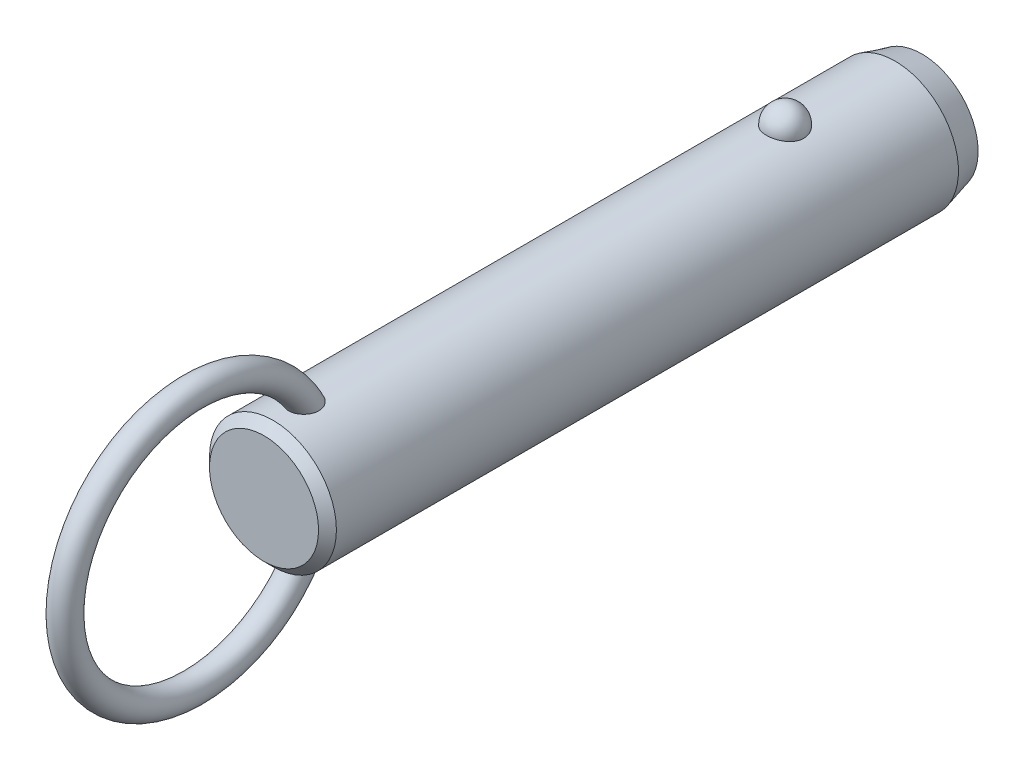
ISO-10303-21;
HEADER;
FILE_DESCRIPTION(('STEP AP214'),'2;1');
FILE_NAME('part.step','',(''),(''),'','','');
FILE_SCHEMA(('AUTOMOTIVE_DESIGN { 1 0 10303 214 1 1 1 1 }'));
ENDSEC;
DATA;
#1=APPLICATION_CONTEXT('core data for automotive mechanical design processes');
#2=APPLICATION_PROTOCOL_DEFINITION('international standard','automotive_design',2000,#1);
#3=PRODUCT_CONTEXT('',#1,'mechanical');
#4=PRODUCT('Part','Part','',(#3));
#5=PRODUCT_RELATED_PRODUCT_CATEGORY('part','',(#4));
#6=PRODUCT_DEFINITION_FORMATION('','',#4);
#7=PRODUCT_DEFINITION_CONTEXT('part definition',#1,'design');
#8=PRODUCT_DEFINITION('design','',#6,#7);
#9=PRODUCT_DEFINITION_SHAPE('','',#8);
#10=(LENGTH_UNIT() NAMED_UNIT(*) SI_UNIT(.MILLI.,.METRE.));
#11=(NAMED_UNIT(*) PLANE_ANGLE_UNIT() SI_UNIT($,.RADIAN.));
#12=(NAMED_UNIT(*) SI_UNIT($,.STERADIAN.) SOLID_ANGLE_UNIT());
#13=UNCERTAINTY_MEASURE_WITH_UNIT(LENGTH_MEASURE(1.E-05),#10,'distance_accuracy_value','');
#14=(GEOMETRIC_REPRESENTATION_CONTEXT(3) GLOBAL_UNCERTAINTY_ASSIGNED_CONTEXT((#13)) GLOBAL_UNIT_ASSIGNED_CONTEXT((#10,
#11,#12)) REPRESENTATION_CONTEXT('',''));
#15=CARTESIAN_POINT('',(0.,0.,0.));
#16=DIRECTION('',(0.,0.,1.));
#17=DIRECTION('',(1.,0.,0.));
#18=AXIS2_PLACEMENT_3D('',#15,#16,#17);
#19=CARTESIAN_POINT('',(0.,0.,48.3));
#20=DIRECTION('',(0.,0.,-1.));
#21=DIRECTION('',(-1.,0.,0.));
#22=AXIS2_PLACEMENT_3D('',#19,#20,#21);
#23=CYLINDRICAL_SURFACE('',#22,7.1);
#24=CARTESIAN_POINT('',(2.0769088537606,6.78943661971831,-2.1));
#25=CARTESIAN_POINT('',(2.07690739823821,6.78943796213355,-1.98268154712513));
#26=CARTESIAN_POINT('',(2.06738130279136,6.79237331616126,-1.86534506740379));
#27=CARTESIAN_POINT('',(2.0295040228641,6.8037853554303,-1.63400788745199));
#28=CARTESIAN_POINT('',(2.00114757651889,6.81226358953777,-1.52000812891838));
#29=CARTESIAN_POINT('',(1.92632025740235,6.83379798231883,-1.29863433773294));
#30=CARTESIAN_POINT('',(1.87985726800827,6.84685214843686,-1.19125744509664));
#31=CARTESIAN_POINT('',(1.76995205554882,6.87608091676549,-0.986046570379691));
#32=CARTESIAN_POINT('',(1.70650980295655,6.8922555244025,-0.888212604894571));
#33=CARTESIAN_POINT('',(1.56381192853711,6.92602930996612,-0.704242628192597));
#34=CARTESIAN_POINT('',(1.4844714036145,6.94363582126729,-0.618173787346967));
#35=CARTESIAN_POINT('',(1.31221746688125,6.97823658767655,-0.460740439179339));
#36=CARTESIAN_POINT('',(1.21930409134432,6.99523084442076,-0.389375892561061));
#37=CARTESIAN_POINT('',(1.02268781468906,7.02666176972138,-0.263547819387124));
#38=CARTESIAN_POINT('',(0.919020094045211,7.04110638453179,-0.209031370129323));
#39=CARTESIAN_POINT('',(0.703548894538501,7.06588726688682,-0.118163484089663));
#40=CARTESIAN_POINT('',(0.591746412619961,7.07622403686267,-0.081809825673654));
#41=CARTESIAN_POINT('',(0.365557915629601,7.09147068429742,-0.0288711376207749));
#42=CARTESIAN_POINT('',(0.251267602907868,7.09648447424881,-0.0119070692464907));
#43=CARTESIAN_POINT('',(0.0213499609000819,7.10089837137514,0.00304925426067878));
#44=CARTESIAN_POINT('',(-0.0942772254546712,7.10029907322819,0.00104351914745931));
#45=CARTESIAN_POINT('',(-0.321651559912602,7.09360829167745,-0.0216931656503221));
#46=CARTESIAN_POINT('',(-0.433431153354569,7.08760388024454,-0.0421272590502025));
#47=CARTESIAN_POINT('',(-0.651862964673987,7.07086131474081,-0.100729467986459));
#48=CARTESIAN_POINT('',(-0.758515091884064,7.06012307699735,-0.138897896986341));
#49=CARTESIAN_POINT('',(-0.96444924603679,7.03496097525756,-0.232213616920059));
#50=CARTESIAN_POINT('',(-1.06368095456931,7.02051445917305,-0.287465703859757));
#51=CARTESIAN_POINT('',(-1.25145353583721,6.98948740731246,-0.413383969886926));
#52=CARTESIAN_POINT('',(-1.33999321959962,6.97290663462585,-0.48405186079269));
#53=CARTESIAN_POINT('',(-1.50591604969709,6.93898770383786,-0.640594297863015));
#54=CARTESIAN_POINT('',(-1.58302488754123,6.92164094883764,-0.72675782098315));
#55=CARTESIAN_POINT('',(-1.72189320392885,6.8884103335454,-0.910927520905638));
#56=CARTESIAN_POINT('',(-1.78365144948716,6.87252659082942,-1.008934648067));
#57=CARTESIAN_POINT('',(-1.89101272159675,6.84377189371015,-1.21549497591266));
#58=CARTESIAN_POINT('',(-1.93639553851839,6.83094274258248,-1.32416860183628));
#59=CARTESIAN_POINT('',(-2.00874275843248,6.81002070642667,-1.54791500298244));
#60=CARTESIAN_POINT('',(-2.03570774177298,6.80192767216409,-1.66298757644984));
#61=CARTESIAN_POINT('',(-2.07047276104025,6.7914266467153,-1.89571453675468));
#62=CARTESIAN_POINT('',(-2.07835878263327,6.78899315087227,-2.01335491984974));
#63=CARTESIAN_POINT('',(-2.07502083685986,6.79001409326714,-2.24833570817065));
#64=CARTESIAN_POINT('',(-2.06379746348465,6.7934683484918,-2.36567612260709));
#65=CARTESIAN_POINT('',(-2.02263913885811,6.80583442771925,-2.59603194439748));
#66=CARTESIAN_POINT('',(-1.99281127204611,6.81471501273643,-2.70906820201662));
#67=CARTESIAN_POINT('',(-1.91526639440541,6.83691232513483,-2.92836575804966));
#68=CARTESIAN_POINT('',(-1.8675486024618,6.85022924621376,-3.03462676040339));
#69=CARTESIAN_POINT('',(-1.75504492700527,6.87991336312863,-3.23806487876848));
#70=CARTESIAN_POINT('',(-1.69015924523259,6.89629822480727,-3.33518422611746));
#71=CARTESIAN_POINT('',(-1.54505404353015,6.93024852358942,-3.51697105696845));
#72=CARTESIAN_POINT('',(-1.46483385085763,6.94781401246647,-3.60163799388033));
#73=CARTESIAN_POINT('',(-1.29071406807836,6.98225977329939,-3.75654119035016));
#74=CARTESIAN_POINT('',(-1.19675650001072,6.99913673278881,-3.82671308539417));
#75=CARTESIAN_POINT('',(-0.997940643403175,7.03023618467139,-3.9501837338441));
#76=CARTESIAN_POINT('',(-0.893083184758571,7.04445887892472,-4.00348377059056));
#77=CARTESIAN_POINT('',(-0.676902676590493,7.06848365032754,-4.09107242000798));
#78=CARTESIAN_POINT('',(-0.565686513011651,7.0783430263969,-4.12560889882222));
#79=CARTESIAN_POINT('',(-0.33873982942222,7.09282534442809,-4.17575450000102));
#80=CARTESIAN_POINT('',(-0.223009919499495,7.09744899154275,-4.19136617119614));
#81=CARTESIAN_POINT('',(0.00707628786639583,7.10090930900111,-4.20307965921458));
#82=CARTESIAN_POINT('',(0.121410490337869,7.09986531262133,-4.19958377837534));
#83=CARTESIAN_POINT('',(0.347815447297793,7.092380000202,-4.17411564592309));
#84=CARTESIAN_POINT('',(0.459886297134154,7.08593891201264,-4.15214417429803));
#85=CARTESIAN_POINT('',(0.678084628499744,7.06838983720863,-4.09049562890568));
#86=CARTESIAN_POINT('',(0.784237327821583,7.05730369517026,-4.05090137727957));
#87=CARTESIAN_POINT('',(0.988305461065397,7.03163139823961,-3.95511447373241));
#88=CARTESIAN_POINT('',(1.08622031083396,7.01704499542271,-3.89892064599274));
#89=CARTESIAN_POINT('',(1.27284490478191,6.98562668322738,-3.77035541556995));
#90=CARTESIAN_POINT('',(1.36137372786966,6.96876135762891,-3.69772964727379));
#91=CARTESIAN_POINT('',(1.52509486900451,6.93477412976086,-3.53878279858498));
#92=CARTESIAN_POINT('',(1.60028496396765,6.91765218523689,-3.45245943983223));
#93=CARTESIAN_POINT('',(1.73681688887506,6.88465753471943,-3.26658774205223));
#94=CARTESIAN_POINT('',(1.79785966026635,6.86881574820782,-3.16681408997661));
#95=CARTESIAN_POINT('',(1.90265327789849,6.84053157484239,-2.95814408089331));
#96=CARTESIAN_POINT('',(1.94640861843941,6.82808830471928,-2.84925010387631));
#97=CARTESIAN_POINT('',(2.01274378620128,6.80881460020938,-2.63454318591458));
#98=CARTESIAN_POINT('',(2.03676193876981,6.80160856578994,-2.52920574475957));
#99=CARTESIAN_POINT('',(2.06884490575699,6.79191902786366,-2.3159172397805));
#100=CARTESIAN_POINT('',(2.07691019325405,6.78943538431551,-2.20796625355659));
#101=CARTESIAN_POINT('',(2.0769088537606,6.78943661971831,-2.1));
#102=B_SPLINE_CURVE_WITH_KNOTS('',3,(#24,#25,#26,#27,#28,#29,#30,#31,#32,#33,#34,#35,#36,#37,
#38,#39,#40,#41,#42,#43,#44,#45,#46,#47,#48,#49,#50,#51,#52,#53,#54,#55,#56,#57,#58,#59,#60,#61,
#62,#63,#64,#65,#66,#67,#68,#69,#70,#71,#72,#73,#74,#75,#76,#77,#78,#79,#80,#81,#82,#83,#84,#85,
#86,#87,#88,#89,#90,#91,#92,#93,#94,#95,#96,#97,#98,#99,#100,#101),.UNSPECIFIED.,.T.,.F.,(4,2,2,
2,2,2,2,2,2,2,2,2,2,2,2,2,2,2,2,2,2,2,2,2,2,2,2,2,2,2,2,2,2,2,2,2,2,2,4),(0.,0.351568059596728,
0.703234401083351,1.05474780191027,1.40626181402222,1.75970563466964,2.11314851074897,
2.4654696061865,2.81774759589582,3.16301449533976,3.50824481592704,3.84801136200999,
4.18778391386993,4.52968352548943,4.87162112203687,5.22076181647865,5.56993054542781,
5.92363364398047,6.27732559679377,6.62942052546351,6.98150450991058,7.33158042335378,
7.68167162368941,8.03384443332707,8.38603269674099,8.73975272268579,9.09344583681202,
9.44234545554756,9.79119807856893,10.1327344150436,10.4742563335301,10.8141898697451,
11.1541474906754,11.4997793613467,11.8454687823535,12.1979079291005,12.5502553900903,
12.8738073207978,13.1973496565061),.UNSPECIFIED.);
#103=CARTESIAN_POINT('',(2.0769088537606,6.78943661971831,-2.1));
#104=VERTEX_POINT('',#103);
#105=EDGE_CURVE('E41',#104,#104,#102,.T.);
#106=ORIENTED_EDGE('',*,*,#105,.T.);
#107=EDGE_LOOP('',(#106));
#108=FACE_BOUND('',#107,.T.);
#109=CARTESIAN_POINT('',(0.,0.,55.22));
#110=DIRECTION('',(0.,0.,1.));
#111=DIRECTION('',(1.,0.,0.));
#112=AXIS2_PLACEMENT_3D('',#109,#110,#111);
#113=CIRCLE('',#112,7.1);
#114=CARTESIAN_POINT('',(7.1,0.,55.22));
#115=VERTEX_POINT('',#114);
#116=EDGE_CURVE('E10',#115,#115,#113,.F.);
#117=ORIENTED_EDGE('',*,*,#116,.T.);
#118=EDGE_LOOP('',(#117));
#119=FACE_BOUND('',#118,.T.);
#120=CARTESIAN_POINT('',(-0.429539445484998,-7.08699541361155,50.0429212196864));
#121=CARTESIAN_POINT('',(-0.50833166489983,-7.08221999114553,50.0668764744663));
#122=CARTESIAN_POINT('',(-0.585039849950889,-7.07624016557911,50.0974570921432));
#123=CARTESIAN_POINT('',(-0.732082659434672,-7.06254296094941,50.1710242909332));
#124=CARTESIAN_POINT('',(-0.802417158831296,-7.05482554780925,50.2140111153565));
#125=CARTESIAN_POINT('',(-0.934722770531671,-7.03851844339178,50.3111135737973));
#126=CARTESIAN_POINT('',(-0.996700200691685,-7.02992941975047,50.3652207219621));
#127=CARTESIAN_POINT('',(-1.11079942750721,-7.01280697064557,50.4829676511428));
#128=CARTESIAN_POINT('',(-1.16292136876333,-7.00427354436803,50.5466072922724));
#129=CARTESIAN_POINT('',(-1.25705660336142,-6.98799959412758,50.6826870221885));
#130=CARTESIAN_POINT('',(-1.29888032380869,-6.98027525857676,50.7552598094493));
#131=CARTESIAN_POINT('',(-1.37069920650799,-6.96652886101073,50.9061686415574));
#132=CARTESIAN_POINT('',(-1.40069157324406,-6.96050720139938,50.9845060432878));
#133=CARTESIAN_POINT('',(-1.45043507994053,-6.95031881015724,51.1501903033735));
#134=CARTESIAN_POINT('',(-1.46937115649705,-6.94630231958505,51.2377897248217));
#135=CARTESIAN_POINT('',(-1.49424917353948,-6.94099239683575,51.4148714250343));
#136=CARTESIAN_POINT('',(-1.50018601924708,-6.93970003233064,51.5043544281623));
#137=CARTESIAN_POINT('',(-1.49978214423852,-6.93978815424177,51.6940607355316));
#138=CARTESIAN_POINT('',(-1.49187639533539,-6.94150934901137,51.794279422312));
#139=CARTESIAN_POINT('',(-1.46177925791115,-6.94790814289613,51.9924798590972));
#140=CARTESIAN_POINT('',(-1.43957541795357,-6.95258831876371,52.090459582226));
#141=CARTESIAN_POINT('',(-1.37783293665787,-6.96510647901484,52.2953629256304));
#142=CARTESIAN_POINT('',(-1.33634073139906,-6.97328848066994,52.4016801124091));
#143=CARTESIAN_POINT('',(-1.23686994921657,-6.99161706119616,52.6061777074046));
#144=CARTESIAN_POINT('',(-1.17889192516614,-7.00176357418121,52.7043583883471));
#145=CARTESIAN_POINT('',(-1.0587512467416,-7.02082898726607,52.8723743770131));
#146=CARTESIAN_POINT('',(-0.999247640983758,-7.02963746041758,52.9441230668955));
#147=CARTESIAN_POINT('',(-0.86949477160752,-7.04686074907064,53.0771959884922));
#148=CARTESIAN_POINT('',(-0.799263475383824,-7.05527619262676,53.1385372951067));
#149=CARTESIAN_POINT('',(-0.665408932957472,-7.06899457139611,53.2351316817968));
#150=CARTESIAN_POINT('',(-0.603817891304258,-7.07457275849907,53.2731512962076));
#151=CARTESIAN_POINT('',(-0.475172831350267,-7.08437420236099,53.3387581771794));
#152=CARTESIAN_POINT('',(-0.40812301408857,-7.08859848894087,53.3663533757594));
#153=CARTESIAN_POINT('',(-0.269431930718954,-7.09522749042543,53.4092569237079));
#154=CARTESIAN_POINT('',(-0.197757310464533,-7.09761688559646,53.4244618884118));
#155=CARTESIAN_POINT('',(-0.0527849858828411,-7.10017268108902,53.4407168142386));
#156=CARTESIAN_POINT('',(0.0205115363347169,-7.10034065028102,53.4417767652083));
#157=CARTESIAN_POINT('',(0.156426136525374,-7.09855986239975,53.4304619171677));
#158=CARTESIAN_POINT('',(0.219199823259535,-7.09688191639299,53.4198060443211));
#159=CARTESIAN_POINT('',(0.342134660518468,-7.09201880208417,53.3885379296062));
#160=CARTESIAN_POINT('',(0.402295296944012,-7.08883333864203,53.3679237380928));
#161=CARTESIAN_POINT('',(0.52068738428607,-7.08113868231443,53.3172125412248));
#162=CARTESIAN_POINT('',(0.578791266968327,-7.07658958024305,53.2868272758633));
#163=CARTESIAN_POINT('',(0.690173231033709,-7.06659708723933,53.2183678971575));
#164=CARTESIAN_POINT('',(0.743447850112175,-7.061153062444,53.1802883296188));
#165=CARTESIAN_POINT('',(0.870947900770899,-7.04680292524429,53.0765929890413));
#166=CARTESIAN_POINT('',(0.941828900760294,-7.0375580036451,53.0068972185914));
#167=CARTESIAN_POINT('',(1.07136606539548,-7.01900793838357,52.8569450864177));
#168=CARTESIAN_POINT('',(1.13000013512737,-7.00970271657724,52.7766700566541));
#169=CARTESIAN_POINT('',(1.23579584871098,-6.99183327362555,52.6068997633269));
#170=CARTESIAN_POINT('',(1.2827427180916,-6.98328455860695,52.5172696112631));
#171=CARTESIAN_POINT('',(1.36351442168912,-6.96796352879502,52.3321763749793));
#172=CARTESIAN_POINT('',(1.39733971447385,-6.96119115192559,52.2367134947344));
#173=CARTESIAN_POINT('',(1.45579181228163,-6.94922464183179,52.0253092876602));
#174=CARTESIAN_POINT('',(1.47790145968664,-6.94449000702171,51.908631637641));
#175=CARTESIAN_POINT('',(1.50168752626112,-6.93938731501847,51.6730153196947));
#176=CARTESIAN_POINT('',(1.50336085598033,-6.93901991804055,51.5540763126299));
#177=CARTESIAN_POINT('',(1.48486516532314,-6.9430010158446,51.3236079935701));
#178=CARTESIAN_POINT('',(1.46573441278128,-6.9471253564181,51.211995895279));
#179=CARTESIAN_POINT('',(1.40606892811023,-6.95944667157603,50.9948868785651));
#180=CARTESIAN_POINT('',(1.36556446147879,-6.96763788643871,50.8893815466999));
#181=CARTESIAN_POINT('',(1.27082700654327,-6.98548038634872,50.7042879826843));
#182=CARTESIAN_POINT('',(1.21949810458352,-6.99473841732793,50.6231719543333));
#183=CARTESIAN_POINT('',(1.10242050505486,-7.01414069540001,50.4722278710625));
#184=CARTESIAN_POINT('',(1.03668119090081,-7.02428436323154,50.4023925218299));
#185=CARTESIAN_POINT('',(0.90055902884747,-7.04295285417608,50.2835735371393));
#186=CARTESIAN_POINT('',(0.831428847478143,-7.05153466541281,50.2331573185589));
#187=CARTESIAN_POINT('',(0.685291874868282,-7.06723150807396,50.1451429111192));
#188=CARTESIAN_POINT('',(0.60828720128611,-7.0743469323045,50.1075412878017));
#189=CARTESIAN_POINT('',(0.451878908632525,-7.08602232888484,50.0474915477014));
#190=CARTESIAN_POINT('',(0.372686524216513,-7.09067127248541,50.0245088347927));
#191=CARTESIAN_POINT('',(0.211477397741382,-7.09730788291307,49.9920357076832));
#192=CARTESIAN_POINT('',(0.129460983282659,-7.09929585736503,49.9825437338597));
#193=CARTESIAN_POINT('',(-0.0332905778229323,-7.10037858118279,49.9773517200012));
#194=CARTESIAN_POINT('',(-0.114016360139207,-7.09953334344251,49.9813656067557));
#195=CARTESIAN_POINT('',(-0.273670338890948,-7.09517338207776,50.0024540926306));
#196=CARTESIAN_POINT('',(-0.352598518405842,-7.09165863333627,50.0195288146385));
#197=CARTESIAN_POINT('',(-0.429539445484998,-7.08699541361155,50.0429212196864));
#198=B_SPLINE_CURVE_WITH_KNOTS('',3,(#120,#121,#122,#123,#124,#125,#126,#127,#128,#129,#130,
#131,#132,#133,#134,#135,#136,#137,#138,#139,#140,#141,#142,#143,#144,#145,#146,#147,#148,#149,
#150,#151,#152,#153,#154,#155,#156,#157,#158,#159,#160,#161,#162,#163,#164,#165,#166,#167,#168,
#169,#170,#171,#172,#173,#174,#175,#176,#177,#178,#179,#180,#181,#182,#183,#184,#185,#186,#187,
#188,#189,#190,#191,#192,#193,#194,#195,#196,#197),.UNSPECIFIED.,.T.,.F.,(4,2,2,2,2,2,2,2,2,2,2,
2,2,2,2,2,2,2,2,2,2,2,2,2,2,2,2,2,2,2,2,2,2,2,2,2,2,2,4),(0.,0.247183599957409,
0.494372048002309,0.741372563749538,0.98836945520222,1.23962059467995,1.49093106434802,
1.75897818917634,2.02713035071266,2.32758265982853,2.62829697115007,2.97008736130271,
3.31186629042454,3.5917531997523,3.87117637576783,4.08813841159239,4.30493502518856,
4.52352259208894,4.74195577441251,4.93215328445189,5.12238804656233,5.31884850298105,
5.51544871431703,5.8133231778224,6.11173048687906,6.41527266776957,6.71880423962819,
7.073581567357,7.42841252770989,7.76631485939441,8.10373999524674,8.3914224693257,
8.67891817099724,8.93560332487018,9.19221962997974,9.43881106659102,9.68537399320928,
9.92674752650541,10.1681233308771),.UNSPECIFIED.);
#199=CARTESIAN_POINT('',(-0.429539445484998,-7.08699541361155,50.0429212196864));
#200=VERTEX_POINT('',#199);
#201=EDGE_CURVE('E59',#200,#200,#198,.T.);
#202=ORIENTED_EDGE('',*,*,#201,.T.);
#203=EDGE_LOOP('',(#202));
#204=FACE_BOUND('',#203,.T.);
#205=CARTESIAN_POINT('',(-0.429539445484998,7.08699541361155,50.0429212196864));
#206=CARTESIAN_POINT('',(-0.351665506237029,7.09171429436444,50.0192469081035));
#207=CARTESIAN_POINT('',(-0.271733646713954,7.09525896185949,50.0020369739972));
#208=CARTESIAN_POINT('',(-0.110026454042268,7.09960839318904,49.9810059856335));
#209=CARTESIAN_POINT('',(-0.0282502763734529,7.10041187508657,49.977191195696));
#210=CARTESIAN_POINT('',(0.134782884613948,7.09918849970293,49.983059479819));
#211=CARTESIAN_POINT('',(0.216039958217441,7.09716214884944,49.9927401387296));
#212=CARTESIAN_POINT('',(0.375730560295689,7.09050177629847,50.0253471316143));
#213=CARTESIAN_POINT('',(0.454164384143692,7.08586802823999,50.0482720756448));
#214=CARTESIAN_POINT('',(0.606025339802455,7.07449911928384,50.106771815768));
#215=CARTESIAN_POINT('',(0.679451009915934,7.06776334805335,50.1423502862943));
#216=CARTESIAN_POINT('',(0.819234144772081,7.05292866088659,50.2251753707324));
#217=CARTESIAN_POINT('',(0.885591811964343,7.04482978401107,50.2724216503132));
#218=CARTESIAN_POINT('',(1.00993211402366,7.02808709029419,50.3775902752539));
#219=CARTESIAN_POINT('',(1.06785399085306,7.01943990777,50.435583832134));
#220=CARTESIAN_POINT('',(1.17342527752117,7.00256662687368,50.5603013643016));
#221=CARTESIAN_POINT('',(1.22107408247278,6.99434055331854,50.6270258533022));
#222=CARTESIAN_POINT('',(1.30652927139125,6.97889183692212,50.7693622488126));
#223=CARTESIAN_POINT('',(1.34399711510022,6.97170674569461,50.8451808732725));
#224=CARTESIAN_POINT('',(1.40682616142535,6.95930080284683,51.0018100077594));
#225=CARTESIAN_POINT('',(1.43218374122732,6.95408053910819,51.0826220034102));
#226=CARTESIAN_POINT('',(1.47246409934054,6.94566853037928,51.2535314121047));
#227=CARTESIAN_POINT('',(1.48642590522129,6.9426653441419,51.3438630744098));
#228=CARTESIAN_POINT('',(1.5011410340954,6.93949744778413,51.525619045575));
#229=CARTESIAN_POINT('',(1.50188917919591,6.93933385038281,51.6170437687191));
#230=CARTESIAN_POINT('',(1.49030464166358,6.94183245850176,51.8108438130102));
#231=CARTESIAN_POINT('',(1.47627413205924,6.94486147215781,51.913112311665));
#232=CARTESIAN_POINT('',(1.43356351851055,6.95380194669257,52.1144719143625));
#233=CARTESIAN_POINT('',(1.4048676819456,6.95971650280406,52.2135594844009));
#234=CARTESIAN_POINT('',(1.32908750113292,6.97461208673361,52.4189087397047));
#235=CARTESIAN_POINT('',(1.28011435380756,6.98388945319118,52.5244566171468));
#236=CARTESIAN_POINT('',(1.16520357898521,7.00397743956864,52.7257604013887));
#237=CARTESIAN_POINT('',(1.09927694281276,7.01478706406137,52.8215225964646));
#238=CARTESIAN_POINT('',(0.969361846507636,7.03373936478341,52.9767565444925));
#239=CARTESIAN_POINT('',(0.909042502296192,7.04187023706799,53.0393032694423));
#240=CARTESIAN_POINT('',(0.779178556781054,7.05741732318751,53.1540535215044));
#241=CARTESIAN_POINT('',(0.709649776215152,7.06483472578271,53.2062744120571));
#242=CARTESIAN_POINT('',(0.576854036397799,7.0767751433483,53.2881138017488));
#243=CARTESIAN_POINT('',(0.515118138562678,7.08158033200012,53.3201641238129));
#244=CARTESIAN_POINT('',(0.387127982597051,7.08972701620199,53.3737656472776));
#245=CARTESIAN_POINT('',(0.320877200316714,7.09306962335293,53.3953248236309));
#246=CARTESIAN_POINT('',(0.185041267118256,7.09791507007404,53.4264005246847));
#247=CARTESIAN_POINT('',(0.115437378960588,7.09940591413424,53.4358385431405));
#248=CARTESIAN_POINT('',(-0.0243157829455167,7.10030171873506,53.4415226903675));
#249=CARTESIAN_POINT('',(-0.094464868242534,7.0997073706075,53.4377731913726));
#250=CARTESIAN_POINT('',(-0.225713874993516,7.09668414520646,53.4185081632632));
#251=CARTESIAN_POINT('',(-0.287006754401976,7.09444865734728,53.4042323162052));
#252=CARTESIAN_POINT('',(-0.406555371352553,7.08860360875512,53.3663685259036));
#253=CARTESIAN_POINT('',(-0.464809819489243,7.08499346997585,53.3427766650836));
#254=CARTESIAN_POINT('',(-0.594955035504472,7.07541654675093,53.2789232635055));
#255=CARTESIAN_POINT('',(-0.665389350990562,7.06906574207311,53.235753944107));
#256=CARTESIAN_POINT('',(-0.798242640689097,7.05530261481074,53.138587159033));
#257=CARTESIAN_POINT('',(-0.860645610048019,7.0478882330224,53.0845686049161));
#258=CARTESIAN_POINT('',(-0.994249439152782,7.03045217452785,52.9509965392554));
#259=CARTESIAN_POINT('',(-1.06260129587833,7.02030745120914,52.8686143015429));
#260=CARTESIAN_POINT('',(-1.18502045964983,7.00068382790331,52.693843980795));
#261=CARTESIAN_POINT('',(-1.239076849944,6.99120544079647,52.601448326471));
#262=CARTESIAN_POINT('',(-1.33335589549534,6.97384343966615,52.4080085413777));
#263=CARTESIAN_POINT('',(-1.3733613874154,6.96598557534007,52.3068564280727));
#264=CARTESIAN_POINT('',(-1.43770677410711,6.9529905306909,52.0995046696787));
#265=CARTESIAN_POINT('',(-1.46204473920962,6.94785368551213,51.99330440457));
#266=CARTESIAN_POINT('',(-1.49537533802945,6.94076296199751,51.7682317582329));
#267=CARTESIAN_POINT('',(-1.50273564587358,6.93914842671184,51.6490975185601));
#268=CARTESIAN_POINT('',(-1.4954555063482,6.94072368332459,51.4114703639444));
#269=CARTESIAN_POINT('',(-1.48082914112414,6.94391040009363,51.2929770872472));
#270=CARTESIAN_POINT('',(-1.43076401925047,6.95438579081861,51.0734325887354));
#271=CARTESIAN_POINT('',(-1.39762227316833,6.96121852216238,50.9718413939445));
#272=CARTESIAN_POINT('',(-1.31211274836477,6.97783941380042,50.7773513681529));
#273=CARTESIAN_POINT('',(-1.25976607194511,6.98762432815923,50.6844431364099));
#274=CARTESIAN_POINT('',(-1.14583073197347,7.00713153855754,50.5241601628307));
#275=CARTESIAN_POINT('',(-1.08665947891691,7.01665982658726,50.4550351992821));
#276=CARTESIAN_POINT('',(-0.956606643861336,7.03556646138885,50.3288786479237));
#277=CARTESIAN_POINT('',(-0.885737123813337,7.04494495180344,50.2718347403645));
#278=CARTESIAN_POINT('',(-0.751558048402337,7.06035735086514,50.1831004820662));
#279=CARTESIAN_POINT('',(-0.690120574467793,7.0666695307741,50.1485932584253));
#280=CARTESIAN_POINT('',(-0.562815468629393,7.07794609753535,50.0887507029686));
#281=CARTESIAN_POINT('',(-0.496948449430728,7.08291067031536,50.0634141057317));
#282=CARTESIAN_POINT('',(-0.429539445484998,7.08699541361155,50.0429212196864));
#283=B_SPLINE_CURVE_WITH_KNOTS('',3,(#205,#206,#207,#208,#209,#210,#211,#212,#213,#214,#215,
#216,#217,#218,#219,#220,#221,#222,#223,#224,#225,#226,#227,#228,#229,#230,#231,#232,#233,#234,
#235,#236,#237,#238,#239,#240,#241,#242,#243,#244,#245,#246,#247,#248,#249,#250,#251,#252,#253,
#254,#255,#256,#257,#258,#259,#260,#261,#262,#263,#264,#265,#266,#267,#268,#269,#270,#271,#272,
#273,#274,#275,#276,#277,#278,#279,#280,#281,#282),.UNSPECIFIED.,.T.,.F.,(4,2,2,2,2,2,2,2,2,2,2,
2,2,2,2,2,2,2,2,2,2,2,2,2,2,2,2,2,2,2,2,2,2,2,2,2,2,2,4),(0.,0.244335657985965,
0.488785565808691,0.733191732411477,0.977572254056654,1.22202379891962,1.46646834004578,
1.71259457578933,1.9587352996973,2.21226768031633,2.46587585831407,2.73913816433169,
3.01250754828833,3.32109936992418,3.63002293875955,3.97863512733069,4.32702187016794,
4.58793945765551,4.84841449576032,5.05676704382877,5.26496096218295,5.47449661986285,
5.68396281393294,5.87205447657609,6.06022532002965,6.30743751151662,6.55513496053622,
6.87602468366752,7.19715875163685,7.52305774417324,7.84899686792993,8.20516155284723,
8.5610982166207,8.88040084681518,9.19935367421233,9.47236282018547,9.74509220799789,
9.95662250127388,10.1681235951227),.UNSPECIFIED.);
#284=CARTESIAN_POINT('',(-0.429539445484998,7.08699541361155,50.0429212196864));
#285=VERTEX_POINT('',#284);
#286=EDGE_CURVE('E67',#285,#285,#283,.T.);
#287=ORIENTED_EDGE('',*,*,#286,.T.);
#288=EDGE_LOOP('',(#287));
#289=FACE_BOUND('',#288,.T.);
#290=CARTESIAN_POINT('',(0.,0.,-14.4000000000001));
#291=DIRECTION('',(0.,0.,-1.));
#292=DIRECTION('',(-1.,0.,0.));
#293=AXIS2_PLACEMENT_3D('',#290,#291,#292);
#294=CIRCLE('',#293,7.1);
#295=CARTESIAN_POINT('',(-7.1,0.,-14.4000000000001));
#296=VERTEX_POINT('',#295);
#297=EDGE_CURVE('E56',#296,#296,#294,.F.);
#298=ORIENTED_EDGE('',*,*,#297,.T.);
#299=EDGE_LOOP('',(#298));
#300=FACE_BOUND('',#299,.T.);
#301=ADVANCED_FACE('F37',(#108,#119,#204,#289,#300),#23,.T.);
#302=CARTESIAN_POINT('',(0.,0.,-17.4));
#303=DIRECTION('',(0.,0.,-1.));
#304=DIRECTION('',(-1.,0.,0.));
#305=AXIS2_PLACEMENT_3D('',#302,#303,#304);
#306=PLANE('',#305);
#307=CARTESIAN_POINT('',(0.,0.,-17.4));
#308=DIRECTION('',(0.,0.,-1.));
#309=DIRECTION('',(-1.,0.,0.));
#310=AXIS2_PLACEMENT_3D('',#307,#308,#309);
#311=CIRCLE('',#310,6.29615242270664);
#312=CARTESIAN_POINT('',(-6.29615242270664,0.,-17.4));
#313=VERTEX_POINT('',#312);
#314=EDGE_CURVE('E66',#313,#313,#311,.T.);
#315=ORIENTED_EDGE('',*,*,#314,.T.);
#316=EDGE_LOOP('',(#315));
#317=FACE_BOUND('',#316,.T.);
#318=ADVANCED_FACE('F85',(#317),#306,.T.);
#319=CARTESIAN_POINT('',(0.,0.,-17.4));
#320=DIRECTION('',(0.,0.,1.));
#321=DIRECTION('',(1.,0.,0.));
#322=AXIS2_PLACEMENT_3D('',#319,#320,#321);
#323=CONICAL_SURFACE('',#322,6.29615242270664,0.261799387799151);
#324=ORIENTED_EDGE('',*,*,#297,.F.);
#325=EDGE_LOOP('',(#324));
#326=FACE_BOUND('',#325,.T.);
#327=ORIENTED_EDGE('',*,*,#314,.F.);
#328=EDGE_LOOP('',(#327));
#329=FACE_BOUND('',#328,.T.);
#330=ADVANCED_FACE('F83',(#326,#329),#323,.T.);
#331=CARTESIAN_POINT('',(0.,0.,56.22));
#332=DIRECTION('',(0.,0.,1.));
#333=DIRECTION('',(1.,0.,0.));
#334=AXIS2_PLACEMENT_3D('',#331,#332,#333);
#335=PLANE('',#334);
#336=CARTESIAN_POINT('',(0.,0.,56.22));
#337=DIRECTION('',(0.,0.,1.));
#338=DIRECTION('',(1.,0.,0.));
#339=AXIS2_PLACEMENT_3D('',#336,#337,#338);
#340=CIRCLE('',#339,6.10000000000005);
#341=CARTESIAN_POINT('',(6.10000000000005,0.,56.22));
#342=VERTEX_POINT('',#341);
#343=EDGE_CURVE('E50',#342,#342,#340,.T.);
#344=ORIENTED_EDGE('',*,*,#343,.T.);
#345=EDGE_LOOP('',(#344));
#346=FACE_BOUND('',#345,.T.);
#347=ADVANCED_FACE('F77',(#346),#335,.T.);
#348=CARTESIAN_POINT('',(0.,0.,64.15));
#349=DIRECTION('',(1.,0.,0.));
#350=DIRECTION('',(0.,0.,-1.));
#351=AXIS2_PLACEMENT_3D('',#348,#349,#350);
#352=TOROIDAL_SURFACE('',#351,14.35,1.5);
#353=ORIENTED_EDGE('',*,*,#286,.F.);
#354=EDGE_LOOP('',(#353));
#355=FACE_BOUND('',#354,.T.);
#356=ORIENTED_EDGE('',*,*,#201,.F.);
#357=EDGE_LOOP('',(#356));
#358=FACE_BOUND('',#357,.T.);
#359=ADVANCED_FACE('F73',(#355,#358),#352,.T.);
#360=CARTESIAN_POINT('',(0.,0.,56.22));
#361=DIRECTION('',(0.,0.,-1.));
#362=DIRECTION('',(-1.,0.,0.));
#363=AXIS2_PLACEMENT_3D('',#360,#361,#362);
#364=CONICAL_SURFACE('',#363,6.10000000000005,0.785398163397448);
#365=ORIENTED_EDGE('',*,*,#116,.F.);
#366=EDGE_LOOP('',(#365));
#367=FACE_BOUND('',#366,.T.);
#368=ORIENTED_EDGE('',*,*,#343,.F.);
#369=EDGE_LOOP('',(#368));
#370=FACE_BOUND('',#369,.T.);
#371=ADVANCED_FACE('F39',(#367,#370),#364,.T.);
#372=CARTESIAN_POINT('',(0.,7.1,-2.1));
#373=DIRECTION('',(0.,1.,0.));
#374=DIRECTION('',(0.,0.,1.));
#375=AXIS2_PLACEMENT_3D('',#372,#373,#374);
#376=SPHERICAL_SURFACE('',#375,2.10000000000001);
#377=ORIENTED_EDGE('',*,*,#105,.F.);
#378=EDGE_LOOP('',(#377));
#379=FACE_BOUND('',#378,.T.);
#380=ADVANCED_FACE('F79',(#379),#376,.T.);
#381=CLOSED_SHELL('',(#301,#318,#330,#347,#359,#371,#380));
#382=MANIFOLD_SOLID_BREP('B2',#381);
#383=ADVANCED_BREP_SHAPE_REPRESENTATION('',(#18,#382),#14);
#384=SHAPE_DEFINITION_REPRESENTATION(#9,#383);
ENDSEC;
END-ISO-10303-21;
